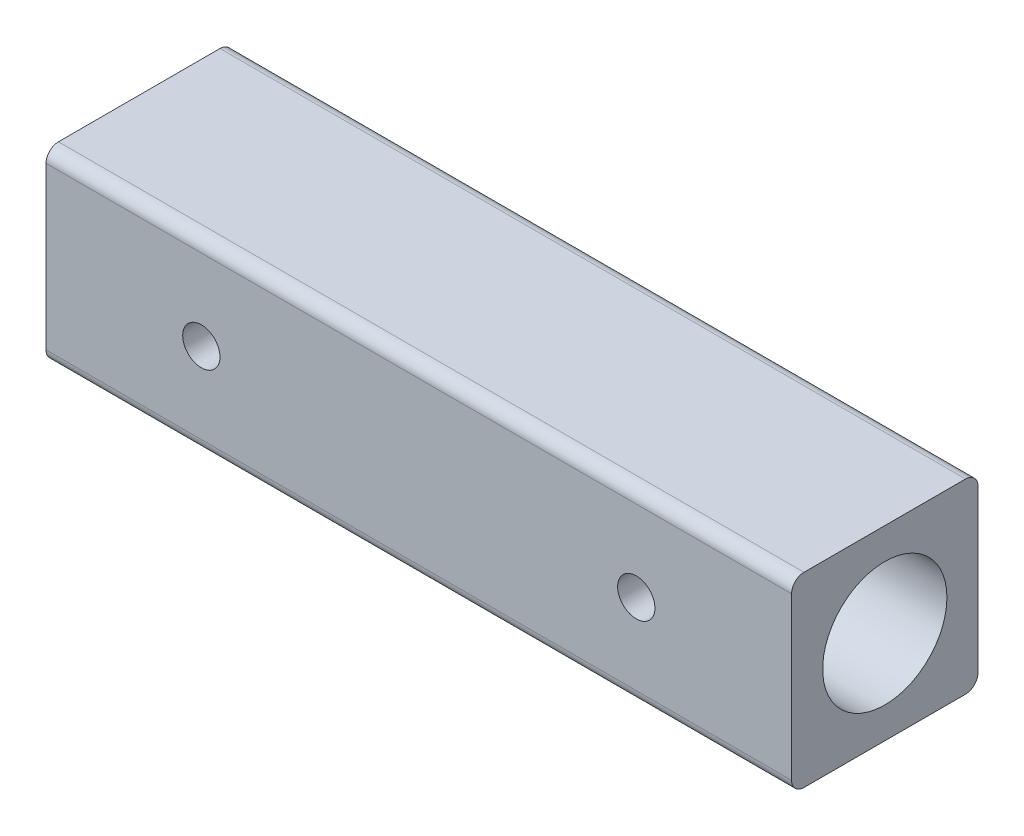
from build123d import *

# Parameters (mm, degrees)
SKETCH1_W           = 30
SKETCH1_H           = 30
BOSS_EXTRUDE1_DEPTH = 120
SKETCH2_R           = 10
CUT_EXTRUDE1_DEPTH  = 40
CUT_EXTRUDE2_DEPTH  = 20
FILLET1_R           = 2


with BuildPart() as part:
    # Sketch1 → Boss-Extrude1 (new body)
    with BuildSketch(Plane(origin=(0, 0, 0), x_dir=(0, 0, -1), z_dir=(1, 0, 0))):
        Rectangle(SKETCH1_W, SKETCH1_H)
    extrude(amount=BOSS_EXTRUDE1_DEPTH)

    # Sketch2 → Cut-Extrude1 (cut)
    with BuildSketch(Plane(origin=(120, 0, 0), x_dir=(0, 0, -1), z_dir=(1, 0, 0))):
        Circle(SKETCH2_R)
    cut_extrude1 = extrude(amount=-CUT_EXTRUDE1_DEPTH, mode=Mode.SUBTRACT)

    # Sketch3 → Cut-Extrude2 (cut, symmetric)
    with BuildSketch(Plane.XY):
        with BuildLine():
            ThreePointArc((98, 0), (97.121320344, 2.121320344), (95, 3))
            Line((95, 3), (95, -3))
            ThreePointArc((95, -3), (97.121320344, -2.121320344), (98, 0))
        make_face()
        with BuildLine():
            Line((95, -3), (95, 3))
            ThreePointArc((95, 3), (92, 0), (95, -3))
        make_face()
        with BuildLine():
            ThreePointArc((98, 0), (97.121320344, 2.121320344), (95, 3))
            Line((95, 3), (95, -3))
            ThreePointArc((95, -3), (97.121320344, -2.121320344), (98, 0))
        make_face()
        with BuildLine():
            Line((95, -3), (95, 3))
            ThreePointArc((95, 3), (92, 0), (95, -3))
        make_face()
    cut_extrude2 = extrude(amount=CUT_EXTRUDE2_DEPTH, both=True, mode=Mode.SUBTRACT)

    # Fillet1
    fillet1_edges = [part.edges().sort_by_distance(p)[0] for p in [
        (60, 15, 15),
        (60, 15, -15),
        (60, -15, -15),
        (60, -15, 15),
    ]]
    fillet(fillet1_edges, radius=FILLET1_R)

    # Mirror1: Cut-Extrude1, Cut-Extrude2 across plane
    add(cut_extrude1.mirror(Plane(origin=(60, 0, 0), x_dir=(0, 0, 1), z_dir=(1, 0, 0))), mode=Mode.SUBTRACT)
    add(cut_extrude2.mirror(Plane(origin=(60, 0, 0), x_dir=(0, 0, 1), z_dir=(1, 0, 0))), mode=Mode.SUBTRACT)


solid = part.part
